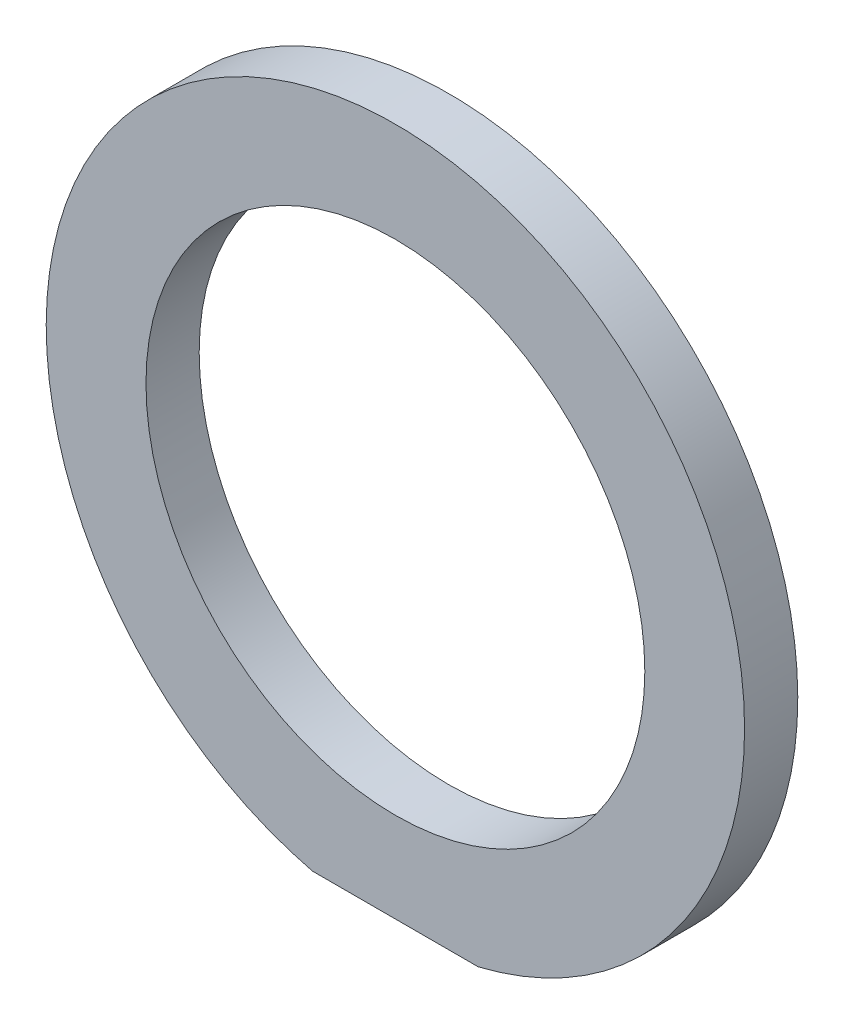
ISO-10303-21;
HEADER;
FILE_DESCRIPTION(('STEP AP214'),'2;1');
FILE_NAME('part.step','',(''),(''),'','','');
FILE_SCHEMA(('AUTOMOTIVE_DESIGN { 1 0 10303 214 1 1 1 1 }'));
ENDSEC;
DATA;
#1=APPLICATION_CONTEXT('core data for automotive mechanical design processes');
#2=APPLICATION_PROTOCOL_DEFINITION('international standard','automotive_design',2000,#1);
#3=PRODUCT_CONTEXT('',#1,'mechanical');
#4=PRODUCT('Part','Part','',(#3));
#5=PRODUCT_RELATED_PRODUCT_CATEGORY('part','',(#4));
#6=PRODUCT_DEFINITION_FORMATION('','',#4);
#7=PRODUCT_DEFINITION_CONTEXT('part definition',#1,'design');
#8=PRODUCT_DEFINITION('design','',#6,#7);
#9=PRODUCT_DEFINITION_SHAPE('','',#8);
#10=(LENGTH_UNIT() NAMED_UNIT(*) SI_UNIT(.MILLI.,.METRE.));
#11=(NAMED_UNIT(*) PLANE_ANGLE_UNIT() SI_UNIT($,.RADIAN.));
#12=(NAMED_UNIT(*) SI_UNIT($,.STERADIAN.) SOLID_ANGLE_UNIT());
#13=UNCERTAINTY_MEASURE_WITH_UNIT(LENGTH_MEASURE(1.E-05),#10,'distance_accuracy_value','');
#14=(GEOMETRIC_REPRESENTATION_CONTEXT(3) GLOBAL_UNCERTAINTY_ASSIGNED_CONTEXT((#13)) GLOBAL_UNIT_ASSIGNED_CONTEXT((#10,
#11,#12)) REPRESENTATION_CONTEXT('',''));
#15=CARTESIAN_POINT('',(0.,0.,0.));
#16=DIRECTION('',(0.,0.,1.));
#17=DIRECTION('',(1.,0.,0.));
#18=AXIS2_PLACEMENT_3D('',#15,#16,#17);
#19=CARTESIAN_POINT('',(0.,0.,8.));
#20=DIRECTION('',(0.,0.,1.));
#21=DIRECTION('',(1.,0.,0.));
#22=AXIS2_PLACEMENT_3D('',#19,#20,#21);
#23=PLANE('',#22);
#24=CARTESIAN_POINT('',(0.,0.,8.));
#25=DIRECTION('',(0.,0.,1.));
#26=DIRECTION('',(1.,0.,0.));
#27=AXIS2_PLACEMENT_3D('',#24,#25,#26);
#28=CIRCLE('',#27,52.5);
#29=CARTESIAN_POINT('',(12.4599357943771,-51.,8.));
#30=VERTEX_POINT('',#29);
#31=CARTESIAN_POINT('',(-12.4599357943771,-51.,8.));
#32=VERTEX_POINT('',#31);
#33=EDGE_CURVE('E62',#30,#32,#28,.T.);
#34=ORIENTED_EDGE('',*,*,#33,.T.);
#35=DIRECTION('',(1.,0.,0.));
#36=VECTOR('',#35,1.);
#37=CARTESIAN_POINT('',(-12.4599357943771,-51.,8.));
#38=LINE('',#37,#36);
#39=EDGE_CURVE('E47',#32,#30,#38,.T.);
#40=ORIENTED_EDGE('',*,*,#39,.T.);
#41=EDGE_LOOP('',(#34,#40));
#42=FACE_BOUND('',#41,.T.);
#43=CARTESIAN_POINT('',(0.,0.,8.));
#44=DIRECTION('',(0.,0.,1.));
#45=DIRECTION('',(1.,0.,0.));
#46=AXIS2_PLACEMENT_3D('',#43,#44,#45);
#47=CIRCLE('',#46,37.5);
#48=CARTESIAN_POINT('',(37.5,0.,8.));
#49=VERTEX_POINT('',#48);
#50=EDGE_CURVE('E68',#49,#49,#47,.T.);
#51=ORIENTED_EDGE('',*,*,#50,.F.);
#52=EDGE_LOOP('',(#51));
#53=FACE_BOUND('',#52,.T.);
#54=ADVANCED_FACE('F31',(#42,#53),#23,.T.);
#55=CARTESIAN_POINT('',(0.,0.,0.));
#56=DIRECTION('',(0.,0.,1.));
#57=DIRECTION('',(1.,0.,0.));
#58=AXIS2_PLACEMENT_3D('',#55,#56,#57);
#59=PLANE('',#58);
#60=CARTESIAN_POINT('',(0.,0.,0.));
#61=DIRECTION('',(0.,0.,1.));
#62=DIRECTION('',(1.,0.,0.));
#63=AXIS2_PLACEMENT_3D('',#60,#61,#62);
#64=CIRCLE('',#63,52.5);
#65=CARTESIAN_POINT('',(12.4599357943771,-51.,0.));
#66=VERTEX_POINT('',#65);
#67=CARTESIAN_POINT('',(-12.4599357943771,-51.,0.));
#68=VERTEX_POINT('',#67);
#69=EDGE_CURVE('E63',#66,#68,#64,.T.);
#70=ORIENTED_EDGE('',*,*,#69,.F.);
#71=DIRECTION('',(1.,0.,0.));
#72=VECTOR('',#71,1.);
#73=CARTESIAN_POINT('',(-12.4599357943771,-51.,0.));
#74=LINE('',#73,#72);
#75=EDGE_CURVE('E55',#68,#66,#74,.T.);
#76=ORIENTED_EDGE('',*,*,#75,.F.);
#77=EDGE_LOOP('',(#70,#76));
#78=FACE_BOUND('',#77,.T.);
#79=CARTESIAN_POINT('',(0.,0.,0.));
#80=DIRECTION('',(0.,0.,1.));
#81=DIRECTION('',(1.,0.,0.));
#82=AXIS2_PLACEMENT_3D('',#79,#80,#81);
#83=CIRCLE('',#82,37.5);
#84=CARTESIAN_POINT('',(37.5,0.,0.));
#85=VERTEX_POINT('',#84);
#86=EDGE_CURVE('E71',#85,#85,#83,.T.);
#87=ORIENTED_EDGE('',*,*,#86,.T.);
#88=EDGE_LOOP('',(#87));
#89=FACE_BOUND('',#88,.T.);
#90=ADVANCED_FACE('F66',(#78,#89),#59,.F.);
#91=CARTESIAN_POINT('',(0.,0.,8.));
#92=DIRECTION('',(0.,0.,-1.));
#93=DIRECTION('',(-1.,0.,0.));
#94=AXIS2_PLACEMENT_3D('',#91,#92,#93);
#95=CYLINDRICAL_SURFACE('',#94,52.5);
#96=ORIENTED_EDGE('',*,*,#69,.T.);
#97=DIRECTION('',(0.,0.,-1.));
#98=VECTOR('',#97,1.);
#99=CARTESIAN_POINT('',(-12.4599357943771,-51.,8.));
#100=LINE('',#99,#98);
#101=EDGE_CURVE('E11',#32,#68,#100,.T.);
#102=ORIENTED_EDGE('',*,*,#101,.F.);
#103=ORIENTED_EDGE('',*,*,#33,.F.);
#104=DIRECTION('',(0.,0.,-1.));
#105=VECTOR('',#104,1.);
#106=CARTESIAN_POINT('',(12.4599357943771,-51.,8.));
#107=LINE('',#106,#105);
#108=EDGE_CURVE('E40',#30,#66,#107,.T.);
#109=ORIENTED_EDGE('',*,*,#108,.T.);
#110=EDGE_LOOP('',(#96,#102,#103,#109));
#111=FACE_BOUND('',#110,.T.);
#112=ADVANCED_FACE('F33',(#111),#95,.T.);
#113=CARTESIAN_POINT('',(-12.4599357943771,-51.,8.));
#114=DIRECTION('',(0.,1.,0.));
#115=DIRECTION('',(0.,0.,1.));
#116=AXIS2_PLACEMENT_3D('',#113,#114,#115);
#117=PLANE('',#116);
#118=ORIENTED_EDGE('',*,*,#75,.T.);
#119=ORIENTED_EDGE('',*,*,#108,.F.);
#120=ORIENTED_EDGE('',*,*,#39,.F.);
#121=ORIENTED_EDGE('',*,*,#101,.T.);
#122=EDGE_LOOP('',(#118,#119,#120,#121));
#123=FACE_BOUND('',#122,.T.);
#124=ADVANCED_FACE('F58',(#123),#117,.F.);
#125=CARTESIAN_POINT('',(0.,0.,8.));
#126=DIRECTION('',(0.,0.,-1.));
#127=DIRECTION('',(-1.,0.,0.));
#128=AXIS2_PLACEMENT_3D('',#125,#126,#127);
#129=CYLINDRICAL_SURFACE('',#128,37.5);
#130=ORIENTED_EDGE('',*,*,#50,.T.);
#131=EDGE_LOOP('',(#130));
#132=FACE_BOUND('',#131,.T.);
#133=ORIENTED_EDGE('',*,*,#86,.F.);
#134=EDGE_LOOP('',(#133));
#135=FACE_BOUND('',#134,.T.);
#136=ADVANCED_FACE('F79',(#132,#135),#129,.F.);
#137=CLOSED_SHELL('',(#54,#90,#112,#124,#136));
#138=MANIFOLD_SOLID_BREP('B2',#137);
#139=ADVANCED_BREP_SHAPE_REPRESENTATION('',(#18,#138),#14);
#140=SHAPE_DEFINITION_REPRESENTATION(#9,#139);
ENDSEC;
END-ISO-10303-21;
